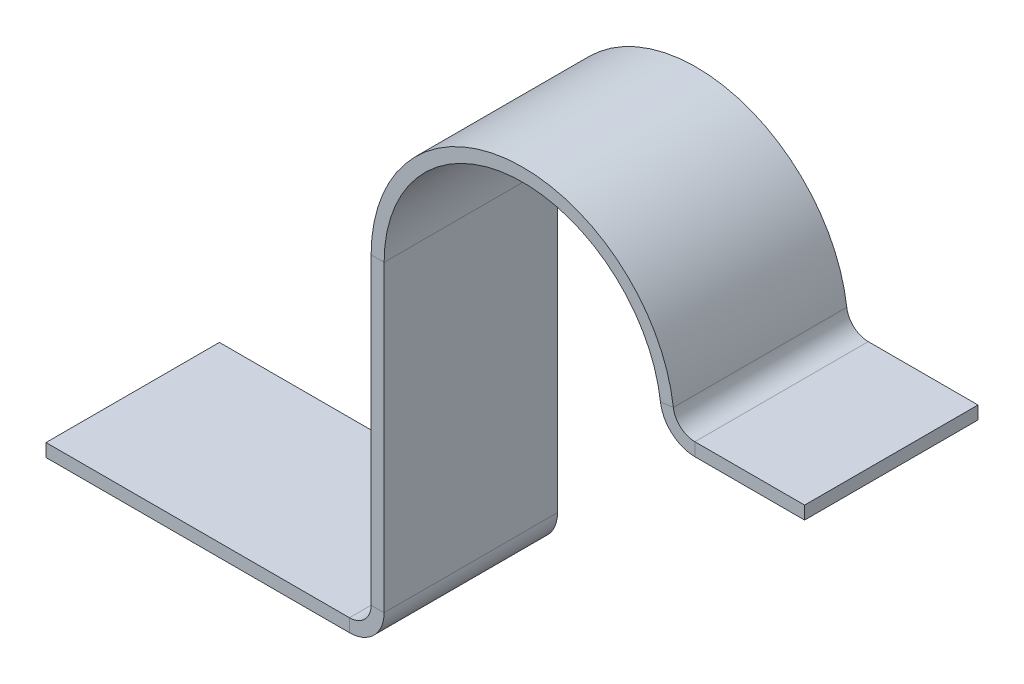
ISO-10303-21;
HEADER;
FILE_DESCRIPTION(('STEP AP214'),'2;1');
FILE_NAME('part.step','',(''),(''),'','','');
FILE_SCHEMA(('AUTOMOTIVE_DESIGN { 1 0 10303 214 1 1 1 1 }'));
ENDSEC;
DATA;
#1=APPLICATION_CONTEXT('core data for automotive mechanical design processes');
#2=APPLICATION_PROTOCOL_DEFINITION('international standard','automotive_design',2000,#1);
#3=PRODUCT_CONTEXT('',#1,'mechanical');
#4=PRODUCT('Part','Part','',(#3));
#5=PRODUCT_RELATED_PRODUCT_CATEGORY('part','',(#4));
#6=PRODUCT_DEFINITION_FORMATION('','',#4);
#7=PRODUCT_DEFINITION_CONTEXT('part definition',#1,'design');
#8=PRODUCT_DEFINITION('design','',#6,#7);
#9=PRODUCT_DEFINITION_SHAPE('','',#8);
#10=(LENGTH_UNIT() NAMED_UNIT(*) SI_UNIT(.MILLI.,.METRE.));
#11=(NAMED_UNIT(*) PLANE_ANGLE_UNIT() SI_UNIT($,.RADIAN.));
#12=(NAMED_UNIT(*) SI_UNIT($,.STERADIAN.) SOLID_ANGLE_UNIT());
#13=UNCERTAINTY_MEASURE_WITH_UNIT(LENGTH_MEASURE(1.E-05),#10,'distance_accuracy_value','');
#14=(GEOMETRIC_REPRESENTATION_CONTEXT(3) GLOBAL_UNCERTAINTY_ASSIGNED_CONTEXT((#13)) GLOBAL_UNIT_ASSIGNED_CONTEXT((#10,
#11,#12)) REPRESENTATION_CONTEXT('',''));
#15=CARTESIAN_POINT('',(0.,0.,0.));
#16=DIRECTION('',(0.,0.,1.));
#17=DIRECTION('',(1.,0.,0.));
#18=AXIS2_PLACEMENT_3D('',#15,#16,#17);
#19=CARTESIAN_POINT('',(78.,75.,40.));
#20=DIRECTION('',(0.,0.,1.));
#21=DIRECTION('',(1.,0.,0.));
#22=AXIS2_PLACEMENT_3D('',#19,#20,#21);
#23=PLANE('',#22);
#24=DIRECTION('',(-1.,0.,0.));
#25=VECTOR('',#24,1.);
#26=CARTESIAN_POINT('',(78.,75.,40.));
#27=LINE('',#26,#25);
#28=CARTESIAN_POINT('',(78.,75.,40.));
#29=VERTEX_POINT('',#28);
#30=CARTESIAN_POINT('',(75.,75.,40.));
#31=VERTEX_POINT('',#30);
#32=EDGE_CURVE('E11',#29,#31,#27,.T.);
#33=ORIENTED_EDGE('',*,*,#32,.F.);
#34=CARTESIAN_POINT('',(110.,75.,40.));
#35=DIRECTION('',(0.,0.,1.));
#36=DIRECTION('',(1.,0.,0.));
#37=AXIS2_PLACEMENT_3D('',#34,#35,#36);
#38=CIRCLE('',#37,32.);
#39=CARTESIAN_POINT('',(141.749015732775,79.,40.));
#40=VERTEX_POINT('',#39);
#41=EDGE_CURVE('E147',#29,#40,#38,.F.);
#42=ORIENTED_EDGE('',*,*,#41,.T.);
#43=DIRECTION('',(0.992156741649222,0.124999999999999,0.));
#44=VECTOR('',#43,1.);
#45=CARTESIAN_POINT('',(141.749015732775,79.,40.));
#46=LINE('',#45,#44);
#47=CARTESIAN_POINT('',(144.725485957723,79.375,40.));
#48=VERTEX_POINT('',#47);
#49=EDGE_CURVE('E252',#40,#48,#46,.T.);
#50=ORIENTED_EDGE('',*,*,#49,.T.);
#51=CARTESIAN_POINT('',(110.,75.,40.));
#52=DIRECTION('',(0.,0.,-1.));
#53=DIRECTION('',(-1.,0.,0.));
#54=AXIS2_PLACEMENT_3D('',#51,#52,#53);
#55=CIRCLE('',#54,35.);
#56=EDGE_CURVE('E150',#31,#48,#55,.T.);
#57=ORIENTED_EDGE('',*,*,#56,.F.);
#58=EDGE_LOOP('',(#33,#42,#50,#57));
#59=FACE_BOUND('',#58,.T.);
#60=ADVANCED_FACE('F36',(#59),#23,.T.);
#61=CARTESIAN_POINT('',(75.,75.,0.));
#62=DIRECTION('',(0.,0.,-1.));
#63=DIRECTION('',(-1.,0.,0.));
#64=AXIS2_PLACEMENT_3D('',#61,#62,#63);
#65=PLANE('',#64);
#66=DIRECTION('',(1.,0.,0.));
#67=VECTOR('',#66,1.);
#68=CARTESIAN_POINT('',(75.,75.,0.));
#69=LINE('',#68,#67);
#70=CARTESIAN_POINT('',(75.,75.,0.));
#71=VERTEX_POINT('',#70);
#72=CARTESIAN_POINT('',(78.,75.,0.));
#73=VERTEX_POINT('',#72);
#74=EDGE_CURVE('E44',#71,#73,#69,.T.);
#75=ORIENTED_EDGE('',*,*,#74,.F.);
#76=CARTESIAN_POINT('',(110.,75.,0.));
#77=DIRECTION('',(0.,0.,-1.));
#78=DIRECTION('',(-1.,0.,0.));
#79=AXIS2_PLACEMENT_3D('',#76,#77,#78);
#80=CIRCLE('',#79,35.);
#81=CARTESIAN_POINT('',(144.725485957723,79.375,0.));
#82=VERTEX_POINT('',#81);
#83=EDGE_CURVE('E195',#71,#82,#80,.T.);
#84=ORIENTED_EDGE('',*,*,#83,.T.);
#85=DIRECTION('',(-0.992156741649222,-0.124999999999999,0.));
#86=VECTOR('',#85,1.);
#87=CARTESIAN_POINT('',(144.725485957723,79.375,0.));
#88=LINE('',#87,#86);
#89=CARTESIAN_POINT('',(141.749015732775,79.,0.));
#90=VERTEX_POINT('',#89);
#91=EDGE_CURVE('E99',#82,#90,#88,.T.);
#92=ORIENTED_EDGE('',*,*,#91,.T.);
#93=CARTESIAN_POINT('',(110.,75.,0.));
#94=DIRECTION('',(0.,0.,1.));
#95=DIRECTION('',(1.,0.,0.));
#96=AXIS2_PLACEMENT_3D('',#93,#94,#95);
#97=CIRCLE('',#96,32.);
#98=EDGE_CURVE('E216',#73,#90,#97,.F.);
#99=ORIENTED_EDGE('',*,*,#98,.F.);
#100=EDGE_LOOP('',(#75,#84,#92,#99));
#101=FACE_BOUND('',#100,.T.);
#102=ADVANCED_FACE('F264',(#101),#65,.T.);
#103=CARTESIAN_POINT('',(75.,5.,40.));
#104=DIRECTION('',(0.,0.,1.));
#105=DIRECTION('',(1.,0.,0.));
#106=AXIS2_PLACEMENT_3D('',#103,#104,#105);
#107=PLANE('',#106);
#108=DIRECTION('',(1.,0.,0.));
#109=VECTOR('',#108,1.);
#110=CARTESIAN_POINT('',(75.,5.,40.));
#111=LINE('',#110,#109);
#112=CARTESIAN_POINT('',(75.,5.,40.));
#113=VERTEX_POINT('',#112);
#114=CARTESIAN_POINT('',(78.,5.,40.));
#115=VERTEX_POINT('',#114);
#116=EDGE_CURVE('E159',#113,#115,#111,.T.);
#117=ORIENTED_EDGE('',*,*,#116,.F.);
#118=CARTESIAN_POINT('',(70.,5.,40.));
#119=DIRECTION('',(0.,0.,-1.));
#120=DIRECTION('',(-1.,0.,0.));
#121=AXIS2_PLACEMENT_3D('',#118,#119,#120);
#122=CIRCLE('',#121,5.);
#123=CARTESIAN_POINT('',(70.,0.,40.));
#124=VERTEX_POINT('',#123);
#125=EDGE_CURVE('E304',#124,#113,#122,.F.);
#126=ORIENTED_EDGE('',*,*,#125,.F.);
#127=DIRECTION('',(0.,1.,0.));
#128=VECTOR('',#127,1.);
#129=CARTESIAN_POINT('',(70.,-3.,40.));
#130=LINE('',#129,#128);
#131=CARTESIAN_POINT('',(70.,-3.,40.));
#132=VERTEX_POINT('',#131);
#133=EDGE_CURVE('E259',#132,#124,#130,.T.);
#134=ORIENTED_EDGE('',*,*,#133,.F.);
#135=CARTESIAN_POINT('',(70.,5.,40.));
#136=DIRECTION('',(0.,0.,1.));
#137=DIRECTION('',(1.,0.,0.));
#138=AXIS2_PLACEMENT_3D('',#135,#136,#137);
#139=CIRCLE('',#138,8.);
#140=EDGE_CURVE('E163',#132,#115,#139,.T.);
#141=ORIENTED_EDGE('',*,*,#140,.T.);
#142=EDGE_LOOP('',(#117,#126,#134,#141));
#143=FACE_BOUND('',#142,.T.);
#144=ADVANCED_FACE('F318',(#143),#107,.T.);
#145=CARTESIAN_POINT('',(70.,-3.,40.));
#146=DIRECTION('',(0.,0.,1.));
#147=DIRECTION('',(1.,0.,0.));
#148=AXIS2_PLACEMENT_3D('',#145,#146,#147);
#149=PLANE('',#148);
#150=DIRECTION('',(0.,1.,0.));
#151=VECTOR('',#150,1.);
#152=CARTESIAN_POINT('',(75.,0.,40.));
#153=LINE('',#152,#151);
#154=EDGE_CURVE('E269',#113,#31,#153,.T.);
#155=ORIENTED_EDGE('',*,*,#154,.F.);
#156=ORIENTED_EDGE('',*,*,#116,.T.);
#157=DIRECTION('',(0.,1.,0.));
#158=VECTOR('',#157,1.);
#159=CARTESIAN_POINT('',(78.,0.,40.));
#160=LINE('',#159,#158);
#161=EDGE_CURVE('E156',#115,#29,#160,.T.);
#162=ORIENTED_EDGE('',*,*,#161,.T.);
#163=ORIENTED_EDGE('',*,*,#32,.T.);
#164=EDGE_LOOP('',(#155,#156,#162,#163));
#165=FACE_BOUND('',#164,.T.);
#166=ADVANCED_FACE('F158',(#165),#149,.T.);
#167=CARTESIAN_POINT('',(70.,0.,0.));
#168=DIRECTION('',(0.,0.,-1.));
#169=DIRECTION('',(-1.,0.,0.));
#170=AXIS2_PLACEMENT_3D('',#167,#168,#169);
#171=PLANE('',#170);
#172=DIRECTION('',(0.,-1.,0.));
#173=VECTOR('',#172,1.);
#174=CARTESIAN_POINT('',(70.,0.,0.));
#175=LINE('',#174,#173);
#176=CARTESIAN_POINT('',(70.,0.,0.));
#177=VERTEX_POINT('',#176);
#178=CARTESIAN_POINT('',(70.,-3.,0.));
#179=VERTEX_POINT('',#178);
#180=EDGE_CURVE('E257',#177,#179,#175,.T.);
#181=ORIENTED_EDGE('',*,*,#180,.F.);
#182=CARTESIAN_POINT('',(70.,5.,0.));
#183=DIRECTION('',(0.,0.,-1.));
#184=DIRECTION('',(-1.,0.,0.));
#185=AXIS2_PLACEMENT_3D('',#182,#183,#184);
#186=CIRCLE('',#185,5.);
#187=CARTESIAN_POINT('',(75.,5.,0.));
#188=VERTEX_POINT('',#187);
#189=EDGE_CURVE('E200',#177,#188,#186,.F.);
#190=ORIENTED_EDGE('',*,*,#189,.T.);
#191=DIRECTION('',(-1.,0.,0.));
#192=VECTOR('',#191,1.);
#193=CARTESIAN_POINT('',(78.,5.,0.));
#194=LINE('',#193,#192);
#195=CARTESIAN_POINT('',(78.,5.,0.));
#196=VERTEX_POINT('',#195);
#197=EDGE_CURVE('E255',#196,#188,#194,.T.);
#198=ORIENTED_EDGE('',*,*,#197,.F.);
#199=CARTESIAN_POINT('',(70.,5.,0.));
#200=DIRECTION('',(0.,0.,1.));
#201=DIRECTION('',(1.,0.,0.));
#202=AXIS2_PLACEMENT_3D('',#199,#200,#201);
#203=CIRCLE('',#202,8.);
#204=EDGE_CURVE('E212',#179,#196,#203,.T.);
#205=ORIENTED_EDGE('',*,*,#204,.F.);
#206=EDGE_LOOP('',(#181,#190,#198,#205));
#207=FACE_BOUND('',#206,.T.);
#208=ADVANCED_FACE('F325',(#207),#171,.T.);
#209=CARTESIAN_POINT('',(78.,5.,0.));
#210=DIRECTION('',(0.,0.,-1.));
#211=DIRECTION('',(-1.,0.,0.));
#212=AXIS2_PLACEMENT_3D('',#209,#210,#211);
#213=PLANE('',#212);
#214=DIRECTION('',(1.,0.,0.));
#215=VECTOR('',#214,1.);
#216=CARTESIAN_POINT('',(0.,0.,0.));
#217=LINE('',#216,#215);
#218=CARTESIAN_POINT('',(0.,0.,0.));
#219=VERTEX_POINT('',#218);
#220=EDGE_CURVE('E203',#219,#177,#217,.T.);
#221=ORIENTED_EDGE('',*,*,#220,.T.);
#222=ORIENTED_EDGE('',*,*,#180,.T.);
#223=DIRECTION('',(1.,0.,0.));
#224=VECTOR('',#223,1.);
#225=CARTESIAN_POINT('',(0.,-3.,0.));
#226=LINE('',#225,#224);
#227=CARTESIAN_POINT('',(0.,-3.,0.));
#228=VERTEX_POINT('',#227);
#229=EDGE_CURVE('E209',#228,#179,#226,.T.);
#230=ORIENTED_EDGE('',*,*,#229,.F.);
#231=DIRECTION('',(0.,1.,0.));
#232=VECTOR('',#231,1.);
#233=CARTESIAN_POINT('',(0.,-3.,0.));
#234=LINE('',#233,#232);
#235=EDGE_CURVE('E206',#228,#219,#234,.T.);
#236=ORIENTED_EDGE('',*,*,#235,.T.);
#237=EDGE_LOOP('',(#221,#222,#230,#236));
#238=FACE_BOUND('',#237,.T.);
#239=ADVANCED_FACE('F345',(#238),#213,.T.);
#240=CARTESIAN_POINT('',(149.686269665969,75.,40.));
#241=DIRECTION('',(0.,0.,1.));
#242=DIRECTION('',(1.,0.,0.));
#243=AXIS2_PLACEMENT_3D('',#240,#241,#242);
#244=PLANE('',#243);
#245=DIRECTION('',(0.,-1.,0.));
#246=VECTOR('',#245,1.);
#247=CARTESIAN_POINT('',(149.686269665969,75.,40.));
#248=LINE('',#247,#246);
#249=CARTESIAN_POINT('',(149.686269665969,75.,40.));
#250=VERTEX_POINT('',#249);
#251=CARTESIAN_POINT('',(149.686269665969,72.,40.));
#252=VERTEX_POINT('',#251);
#253=EDGE_CURVE('E52',#250,#252,#248,.T.);
#254=ORIENTED_EDGE('',*,*,#253,.F.);
#255=CARTESIAN_POINT('',(149.686269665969,80.,40.));
#256=DIRECTION('',(0.,0.,-1.));
#257=DIRECTION('',(-1.,0.,0.));
#258=AXIS2_PLACEMENT_3D('',#255,#256,#257);
#259=CIRCLE('',#258,5.);
#260=EDGE_CURVE('E297',#48,#250,#259,.F.);
#261=ORIENTED_EDGE('',*,*,#260,.F.);
#262=ORIENTED_EDGE('',*,*,#49,.F.);
#263=CARTESIAN_POINT('',(149.686269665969,80.,40.));
#264=DIRECTION('',(0.,0.,1.));
#265=DIRECTION('',(1.,0.,0.));
#266=AXIS2_PLACEMENT_3D('',#263,#264,#265);
#267=CIRCLE('',#266,8.);
#268=EDGE_CURVE('E178',#40,#252,#267,.T.);
#269=ORIENTED_EDGE('',*,*,#268,.T.);
#270=EDGE_LOOP('',(#254,#261,#262,#269));
#271=FACE_BOUND('',#270,.T.);
#272=ADVANCED_FACE('F347',(#271),#244,.T.);
#273=CARTESIAN_POINT('',(141.749015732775,79.,40.));
#274=DIRECTION('',(0.,0.,1.));
#275=DIRECTION('',(1.,0.,0.));
#276=AXIS2_PLACEMENT_3D('',#273,#274,#275);
#277=PLANE('',#276);
#278=DIRECTION('',(1.,0.,0.));
#279=VECTOR('',#278,1.);
#280=CARTESIAN_POINT('',(145.,75.,40.));
#281=LINE('',#280,#279);
#282=CARTESIAN_POINT('',(175.,75.,40.));
#283=VERTEX_POINT('',#282);
#284=EDGE_CURVE('E295',#250,#283,#281,.T.);
#285=ORIENTED_EDGE('',*,*,#284,.F.);
#286=ORIENTED_EDGE('',*,*,#253,.T.);
#287=DIRECTION('',(1.,0.,0.));
#288=VECTOR('',#287,1.);
#289=CARTESIAN_POINT('',(145.,72.,40.));
#290=LINE('',#289,#288);
#291=CARTESIAN_POINT('',(175.,72.,40.));
#292=VERTEX_POINT('',#291);
#293=EDGE_CURVE('E112',#252,#292,#290,.T.);
#294=ORIENTED_EDGE('',*,*,#293,.T.);
#295=DIRECTION('',(0.,-1.,0.));
#296=VECTOR('',#295,1.);
#297=CARTESIAN_POINT('',(175.,75.,40.));
#298=LINE('',#297,#296);
#299=EDGE_CURVE('E293',#283,#292,#298,.T.);
#300=ORIENTED_EDGE('',*,*,#299,.F.);
#301=EDGE_LOOP('',(#285,#286,#294,#300));
#302=FACE_BOUND('',#301,.T.);
#303=ADVANCED_FACE('F353',(#302),#277,.T.);
#304=CARTESIAN_POINT('',(144.725485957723,79.375,0.));
#305=DIRECTION('',(0.,0.,-1.));
#306=DIRECTION('',(-1.,0.,0.));
#307=AXIS2_PLACEMENT_3D('',#304,#305,#306);
#308=PLANE('',#307);
#309=ORIENTED_EDGE('',*,*,#91,.F.);
#310=CARTESIAN_POINT('',(149.686269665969,80.,0.));
#311=DIRECTION('',(0.,0.,-1.));
#312=DIRECTION('',(-1.,0.,0.));
#313=AXIS2_PLACEMENT_3D('',#310,#311,#312);
#314=CIRCLE('',#313,5.);
#315=CARTESIAN_POINT('',(149.686269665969,75.,0.));
#316=VERTEX_POINT('',#315);
#317=EDGE_CURVE('E193',#82,#316,#314,.F.);
#318=ORIENTED_EDGE('',*,*,#317,.T.);
#319=DIRECTION('',(0.,1.,0.));
#320=VECTOR('',#319,1.);
#321=CARTESIAN_POINT('',(149.686269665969,72.,0.));
#322=LINE('',#321,#320);
#323=CARTESIAN_POINT('',(149.686269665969,72.,0.));
#324=VERTEX_POINT('',#323);
#325=EDGE_CURVE('E106',#324,#316,#322,.T.);
#326=ORIENTED_EDGE('',*,*,#325,.F.);
#327=CARTESIAN_POINT('',(149.686269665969,80.,0.));
#328=DIRECTION('',(0.,0.,1.));
#329=DIRECTION('',(1.,0.,0.));
#330=AXIS2_PLACEMENT_3D('',#327,#328,#329);
#331=CIRCLE('',#330,8.);
#332=EDGE_CURVE('E218',#90,#324,#331,.T.);
#333=ORIENTED_EDGE('',*,*,#332,.F.);
#334=EDGE_LOOP('',(#309,#318,#326,#333));
#335=FACE_BOUND('',#334,.T.);
#336=ADVANCED_FACE('F280',(#335),#308,.T.);
#337=CARTESIAN_POINT('',(149.686269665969,72.,0.));
#338=DIRECTION('',(0.,0.,-1.));
#339=DIRECTION('',(-1.,0.,0.));
#340=AXIS2_PLACEMENT_3D('',#337,#338,#339);
#341=PLANE('',#340);
#342=DIRECTION('',(0.,1.,0.));
#343=VECTOR('',#342,1.);
#344=CARTESIAN_POINT('',(75.,0.,0.));
#345=LINE('',#344,#343);
#346=EDGE_CURVE('E197',#188,#71,#345,.T.);
#347=ORIENTED_EDGE('',*,*,#346,.T.);
#348=ORIENTED_EDGE('',*,*,#74,.T.);
#349=DIRECTION('',(0.,1.,0.));
#350=VECTOR('',#349,1.);
#351=CARTESIAN_POINT('',(78.,0.,0.));
#352=LINE('',#351,#350);
#353=EDGE_CURVE('E170',#196,#73,#352,.T.);
#354=ORIENTED_EDGE('',*,*,#353,.F.);
#355=ORIENTED_EDGE('',*,*,#197,.T.);
#356=EDGE_LOOP('',(#347,#348,#354,#355));
#357=FACE_BOUND('',#356,.T.);
#358=ADVANCED_FACE('F262',(#357),#341,.T.);
#359=CARTESIAN_POINT('',(145.,72.,40.));
#360=DIRECTION('',(0.,1.,0.));
#361=DIRECTION('',(0.,0.,1.));
#362=AXIS2_PLACEMENT_3D('',#359,#360,#361);
#363=PLANE('',#362);
#364=DIRECTION('',(1.,0.,0.));
#365=VECTOR('',#364,1.);
#366=CARTESIAN_POINT('',(145.,72.,0.));
#367=LINE('',#366,#365);
#368=CARTESIAN_POINT('',(175.,72.,0.));
#369=VERTEX_POINT('',#368);
#370=EDGE_CURVE('E184',#324,#369,#367,.T.);
#371=ORIENTED_EDGE('',*,*,#370,.T.);
#372=DIRECTION('',(0.,0.,-1.));
#373=VECTOR('',#372,1.);
#374=CARTESIAN_POINT('',(175.,72.,40.));
#375=LINE('',#374,#373);
#376=EDGE_CURVE('E248',#292,#369,#375,.T.);
#377=ORIENTED_EDGE('',*,*,#376,.F.);
#378=ORIENTED_EDGE('',*,*,#293,.F.);
#379=DIRECTION('',(0.,0.,-1.));
#380=VECTOR('',#379,1.);
#381=CARTESIAN_POINT('',(149.686269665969,72.,40.));
#382=LINE('',#381,#380);
#383=EDGE_CURVE('E180',#252,#324,#382,.T.);
#384=ORIENTED_EDGE('',*,*,#383,.T.);
#385=EDGE_LOOP('',(#371,#377,#378,#384));
#386=FACE_BOUND('',#385,.T.);
#387=ADVANCED_FACE('F286',(#386),#363,.F.);
#388=CARTESIAN_POINT('',(175.,75.,40.));
#389=DIRECTION('',(1.,0.,0.));
#390=DIRECTION('',(0.,0.,-1.));
#391=AXIS2_PLACEMENT_3D('',#388,#389,#390);
#392=PLANE('',#391);
#393=DIRECTION('',(0.,-1.,0.));
#394=VECTOR('',#393,1.);
#395=CARTESIAN_POINT('',(175.,75.,0.));
#396=LINE('',#395,#394);
#397=CARTESIAN_POINT('',(175.,75.,0.));
#398=VERTEX_POINT('',#397);
#399=EDGE_CURVE('E187',#398,#369,#396,.T.);
#400=ORIENTED_EDGE('',*,*,#399,.F.);
#401=DIRECTION('',(0.,0.,-1.));
#402=VECTOR('',#401,1.);
#403=CARTESIAN_POINT('',(175.,75.,40.));
#404=LINE('',#403,#402);
#405=EDGE_CURVE('E246',#283,#398,#404,.T.);
#406=ORIENTED_EDGE('',*,*,#405,.F.);
#407=ORIENTED_EDGE('',*,*,#299,.T.);
#408=ORIENTED_EDGE('',*,*,#376,.T.);
#409=EDGE_LOOP('',(#400,#406,#407,#408));
#410=FACE_BOUND('',#409,.T.);
#411=ADVANCED_FACE('F291',(#410),#392,.T.);
#412=CARTESIAN_POINT('',(145.,75.,40.));
#413=DIRECTION('',(0.,1.,0.));
#414=DIRECTION('',(0.,0.,1.));
#415=AXIS2_PLACEMENT_3D('',#412,#413,#414);
#416=PLANE('',#415);
#417=DIRECTION('',(1.,0.,0.));
#418=VECTOR('',#417,1.);
#419=CARTESIAN_POINT('',(145.,75.,0.));
#420=LINE('',#419,#418);
#421=EDGE_CURVE('E190',#316,#398,#420,.T.);
#422=ORIENTED_EDGE('',*,*,#421,.F.);
#423=DIRECTION('',(0.,0.,-1.));
#424=VECTOR('',#423,1.);
#425=CARTESIAN_POINT('',(149.686269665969,75.,40.));
#426=LINE('',#425,#424);
#427=EDGE_CURVE('E243',#250,#316,#426,.T.);
#428=ORIENTED_EDGE('',*,*,#427,.F.);
#429=ORIENTED_EDGE('',*,*,#284,.T.);
#430=ORIENTED_EDGE('',*,*,#405,.T.);
#431=EDGE_LOOP('',(#422,#428,#429,#430));
#432=FACE_BOUND('',#431,.T.);
#433=ADVANCED_FACE('F433',(#432),#416,.T.);
#434=CARTESIAN_POINT('',(149.686269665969,80.,40.));
#435=DIRECTION('',(0.,0.,-1.));
#436=DIRECTION('',(-1.,0.,0.));
#437=AXIS2_PLACEMENT_3D('',#434,#435,#436);
#438=CYLINDRICAL_SURFACE('',#437,5.);
#439=ORIENTED_EDGE('',*,*,#317,.F.);
#440=DIRECTION('',(0.,0.,-1.));
#441=VECTOR('',#440,1.);
#442=CARTESIAN_POINT('',(144.725485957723,79.375,40.));
#443=LINE('',#442,#441);
#444=EDGE_CURVE('E240',#48,#82,#443,.T.);
#445=ORIENTED_EDGE('',*,*,#444,.F.);
#446=ORIENTED_EDGE('',*,*,#260,.T.);
#447=ORIENTED_EDGE('',*,*,#427,.T.);
#448=EDGE_LOOP('',(#439,#445,#446,#447));
#449=FACE_BOUND('',#448,.T.);
#450=ADVANCED_FACE('F277',(#449),#438,.F.);
#451=CARTESIAN_POINT('',(110.,75.,40.));
#452=DIRECTION('',(0.,0.,-1.));
#453=DIRECTION('',(-1.,0.,0.));
#454=AXIS2_PLACEMENT_3D('',#451,#452,#453);
#455=CYLINDRICAL_SURFACE('',#454,35.);
#456=ORIENTED_EDGE('',*,*,#83,.F.);
#457=DIRECTION('',(0.,0.,-1.));
#458=VECTOR('',#457,1.);
#459=CARTESIAN_POINT('',(75.,75.,40.));
#460=LINE('',#459,#458);
#461=EDGE_CURVE('E237',#31,#71,#460,.T.);
#462=ORIENTED_EDGE('',*,*,#461,.F.);
#463=ORIENTED_EDGE('',*,*,#56,.T.);
#464=ORIENTED_EDGE('',*,*,#444,.T.);
#465=EDGE_LOOP('',(#456,#462,#463,#464));
#466=FACE_BOUND('',#465,.T.);
#467=ADVANCED_FACE('F271',(#466),#455,.T.);
#468=CARTESIAN_POINT('',(75.,0.,40.));
#469=DIRECTION('',(-1.,0.,0.));
#470=DIRECTION('',(0.,0.,1.));
#471=AXIS2_PLACEMENT_3D('',#468,#469,#470);
#472=PLANE('',#471);
#473=ORIENTED_EDGE('',*,*,#346,.F.);
#474=DIRECTION('',(0.,0.,-1.));
#475=VECTOR('',#474,1.);
#476=CARTESIAN_POINT('',(75.,5.,40.));
#477=LINE('',#476,#475);
#478=EDGE_CURVE('E234',#113,#188,#477,.T.);
#479=ORIENTED_EDGE('',*,*,#478,.F.);
#480=ORIENTED_EDGE('',*,*,#154,.T.);
#481=ORIENTED_EDGE('',*,*,#461,.T.);
#482=EDGE_LOOP('',(#473,#479,#480,#481));
#483=FACE_BOUND('',#482,.T.);
#484=ADVANCED_FACE('F267',(#483),#472,.T.);
#485=CARTESIAN_POINT('',(70.,5.,40.));
#486=DIRECTION('',(0.,0.,-1.));
#487=DIRECTION('',(-1.,0.,0.));
#488=AXIS2_PLACEMENT_3D('',#485,#486,#487);
#489=CYLINDRICAL_SURFACE('',#488,5.);
#490=ORIENTED_EDGE('',*,*,#189,.F.);
#491=DIRECTION('',(0.,0.,-1.));
#492=VECTOR('',#491,1.);
#493=CARTESIAN_POINT('',(70.,0.,40.));
#494=LINE('',#493,#492);
#495=EDGE_CURVE('E231',#124,#177,#494,.T.);
#496=ORIENTED_EDGE('',*,*,#495,.F.);
#497=ORIENTED_EDGE('',*,*,#125,.T.);
#498=ORIENTED_EDGE('',*,*,#478,.T.);
#499=EDGE_LOOP('',(#490,#496,#497,#498));
#500=FACE_BOUND('',#499,.T.);
#501=ADVANCED_FACE('F328',(#500),#489,.F.);
#502=CARTESIAN_POINT('',(0.,0.,40.));
#503=DIRECTION('',(0.,1.,0.));
#504=DIRECTION('',(0.,0.,1.));
#505=AXIS2_PLACEMENT_3D('',#502,#503,#504);
#506=PLANE('',#505);
#507=ORIENTED_EDGE('',*,*,#220,.F.);
#508=DIRECTION('',(0.,0.,-1.));
#509=VECTOR('',#508,1.);
#510=CARTESIAN_POINT('',(0.,0.,40.));
#511=LINE('',#510,#509);
#512=CARTESIAN_POINT('',(0.,0.,40.));
#513=VERTEX_POINT('',#512);
#514=EDGE_CURVE('E229',#513,#219,#511,.T.);
#515=ORIENTED_EDGE('',*,*,#514,.F.);
#516=DIRECTION('',(1.,0.,0.));
#517=VECTOR('',#516,1.);
#518=CARTESIAN_POINT('',(0.,0.,40.));
#519=LINE('',#518,#517);
#520=EDGE_CURVE('E307',#513,#124,#519,.T.);
#521=ORIENTED_EDGE('',*,*,#520,.T.);
#522=ORIENTED_EDGE('',*,*,#495,.T.);
#523=EDGE_LOOP('',(#507,#515,#521,#522));
#524=FACE_BOUND('',#523,.T.);
#525=ADVANCED_FACE('F333',(#524),#506,.T.);
#526=CARTESIAN_POINT('',(0.,-3.,40.));
#527=DIRECTION('',(-1.,0.,0.));
#528=DIRECTION('',(0.,0.,1.));
#529=AXIS2_PLACEMENT_3D('',#526,#527,#528);
#530=PLANE('',#529);
#531=ORIENTED_EDGE('',*,*,#235,.F.);
#532=DIRECTION('',(0.,0.,-1.));
#533=VECTOR('',#532,1.);
#534=CARTESIAN_POINT('',(0.,-3.,40.));
#535=LINE('',#534,#533);
#536=CARTESIAN_POINT('',(0.,-3.,40.));
#537=VERTEX_POINT('',#536);
#538=EDGE_CURVE('E227',#537,#228,#535,.T.);
#539=ORIENTED_EDGE('',*,*,#538,.F.);
#540=DIRECTION('',(0.,1.,0.));
#541=VECTOR('',#540,1.);
#542=CARTESIAN_POINT('',(0.,-3.,40.));
#543=LINE('',#542,#541);
#544=EDGE_CURVE('E310',#537,#513,#543,.T.);
#545=ORIENTED_EDGE('',*,*,#544,.T.);
#546=ORIENTED_EDGE('',*,*,#514,.T.);
#547=EDGE_LOOP('',(#531,#539,#545,#546));
#548=FACE_BOUND('',#547,.T.);
#549=ADVANCED_FACE('F339',(#548),#530,.T.);
#550=CARTESIAN_POINT('',(0.,-3.,40.));
#551=DIRECTION('',(0.,1.,0.));
#552=DIRECTION('',(0.,0.,1.));
#553=AXIS2_PLACEMENT_3D('',#550,#551,#552);
#554=PLANE('',#553);
#555=ORIENTED_EDGE('',*,*,#229,.T.);
#556=DIRECTION('',(0.,0.,-1.));
#557=VECTOR('',#556,1.);
#558=CARTESIAN_POINT('',(70.,-3.,40.));
#559=LINE('',#558,#557);
#560=EDGE_CURVE('E224',#132,#179,#559,.T.);
#561=ORIENTED_EDGE('',*,*,#560,.F.);
#562=DIRECTION('',(1.,0.,0.));
#563=VECTOR('',#562,1.);
#564=CARTESIAN_POINT('',(0.,-3.,40.));
#565=LINE('',#564,#563);
#566=EDGE_CURVE('E313',#537,#132,#565,.T.);
#567=ORIENTED_EDGE('',*,*,#566,.F.);
#568=ORIENTED_EDGE('',*,*,#538,.T.);
#569=EDGE_LOOP('',(#555,#561,#567,#568));
#570=FACE_BOUND('',#569,.T.);
#571=ADVANCED_FACE('F343',(#570),#554,.F.);
#572=CARTESIAN_POINT('',(70.,5.,40.));
#573=DIRECTION('',(0.,0.,-1.));
#574=DIRECTION('',(-1.,0.,0.));
#575=AXIS2_PLACEMENT_3D('',#572,#573,#574);
#576=CYLINDRICAL_SURFACE('',#575,8.);
#577=ORIENTED_EDGE('',*,*,#204,.T.);
#578=DIRECTION('',(0.,0.,-1.));
#579=VECTOR('',#578,1.);
#580=CARTESIAN_POINT('',(78.,5.,40.));
#581=LINE('',#580,#579);
#582=EDGE_CURVE('E172',#115,#196,#581,.T.);
#583=ORIENTED_EDGE('',*,*,#582,.F.);
#584=ORIENTED_EDGE('',*,*,#140,.F.);
#585=ORIENTED_EDGE('',*,*,#560,.T.);
#586=EDGE_LOOP('',(#577,#583,#584,#585));
#587=FACE_BOUND('',#586,.T.);
#588=ADVANCED_FACE('F321',(#587),#576,.T.);
#589=CARTESIAN_POINT('',(78.,0.,40.));
#590=DIRECTION('',(-1.,0.,0.));
#591=DIRECTION('',(0.,0.,1.));
#592=AXIS2_PLACEMENT_3D('',#589,#590,#591);
#593=PLANE('',#592);
#594=ORIENTED_EDGE('',*,*,#353,.T.);
#595=DIRECTION('',(0.,0.,-1.));
#596=VECTOR('',#595,1.);
#597=CARTESIAN_POINT('',(78.,75.,40.));
#598=LINE('',#597,#596);
#599=EDGE_CURVE('E167',#29,#73,#598,.T.);
#600=ORIENTED_EDGE('',*,*,#599,.F.);
#601=ORIENTED_EDGE('',*,*,#161,.F.);
#602=ORIENTED_EDGE('',*,*,#582,.T.);
#603=EDGE_LOOP('',(#594,#600,#601,#602));
#604=FACE_BOUND('',#603,.T.);
#605=ADVANCED_FACE('F168',(#604),#593,.F.);
#606=CARTESIAN_POINT('',(110.,75.,40.));
#607=DIRECTION('',(0.,0.,-1.));
#608=DIRECTION('',(-1.,0.,0.));
#609=AXIS2_PLACEMENT_3D('',#606,#607,#608);
#610=CYLINDRICAL_SURFACE('',#609,32.);
#611=ORIENTED_EDGE('',*,*,#98,.T.);
#612=DIRECTION('',(0.,0.,-1.));
#613=VECTOR('',#612,1.);
#614=CARTESIAN_POINT('',(141.749015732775,79.,40.));
#615=LINE('',#614,#613);
#616=EDGE_CURVE('E173',#40,#90,#615,.T.);
#617=ORIENTED_EDGE('',*,*,#616,.F.);
#618=ORIENTED_EDGE('',*,*,#41,.F.);
#619=ORIENTED_EDGE('',*,*,#599,.T.);
#620=EDGE_LOOP('',(#611,#617,#618,#619));
#621=FACE_BOUND('',#620,.T.);
#622=ADVANCED_FACE('F175',(#621),#610,.F.);
#623=CARTESIAN_POINT('',(149.686269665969,80.,40.));
#624=DIRECTION('',(0.,0.,-1.));
#625=DIRECTION('',(-1.,0.,0.));
#626=AXIS2_PLACEMENT_3D('',#623,#624,#625);
#627=CYLINDRICAL_SURFACE('',#626,8.);
#628=ORIENTED_EDGE('',*,*,#332,.T.);
#629=ORIENTED_EDGE('',*,*,#383,.F.);
#630=ORIENTED_EDGE('',*,*,#268,.F.);
#631=ORIENTED_EDGE('',*,*,#616,.T.);
#632=EDGE_LOOP('',(#628,#629,#630,#631));
#633=FACE_BOUND('',#632,.T.);
#634=ADVANCED_FACE('F283',(#633),#627,.T.);
#635=CARTESIAN_POINT('',(149.686269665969,80.,40.));
#636=DIRECTION('',(0.,0.,-1.));
#637=DIRECTION('',(-1.,0.,0.));
#638=AXIS2_PLACEMENT_3D('',#635,#636,#637);
#639=PLANE('',#638);
#640=ORIENTED_EDGE('',*,*,#566,.T.);
#641=ORIENTED_EDGE('',*,*,#133,.T.);
#642=ORIENTED_EDGE('',*,*,#520,.F.);
#643=ORIENTED_EDGE('',*,*,#544,.F.);
#644=EDGE_LOOP('',(#640,#641,#642,#643));
#645=FACE_BOUND('',#644,.T.);
#646=ADVANCED_FACE('F336',(#645),#639,.F.);
#647=CARTESIAN_POINT('',(149.686269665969,80.,0.));
#648=DIRECTION('',(0.,0.,-1.));
#649=DIRECTION('',(-1.,0.,0.));
#650=AXIS2_PLACEMENT_3D('',#647,#648,#649);
#651=PLANE('',#650);
#652=ORIENTED_EDGE('',*,*,#370,.F.);
#653=ORIENTED_EDGE('',*,*,#325,.T.);
#654=ORIENTED_EDGE('',*,*,#421,.T.);
#655=ORIENTED_EDGE('',*,*,#399,.T.);
#656=EDGE_LOOP('',(#652,#653,#654,#655));
#657=FACE_BOUND('',#656,.T.);
#658=ADVANCED_FACE('F288',(#657),#651,.T.);
#659=CLOSED_SHELL('',(#60,#102,#144,#166,#208,#239,#272,#303,#336,#358,#387,#411,#433,#450,#467,
#484,#501,#525,#549,#571,#588,#605,#622,#634,#646,#658));
#660=MANIFOLD_SOLID_BREP('B2',#659);
#661=ADVANCED_BREP_SHAPE_REPRESENTATION('',(#18,#660),#14);
#662=SHAPE_DEFINITION_REPRESENTATION(#9,#661);
ENDSEC;
END-ISO-10303-21;
